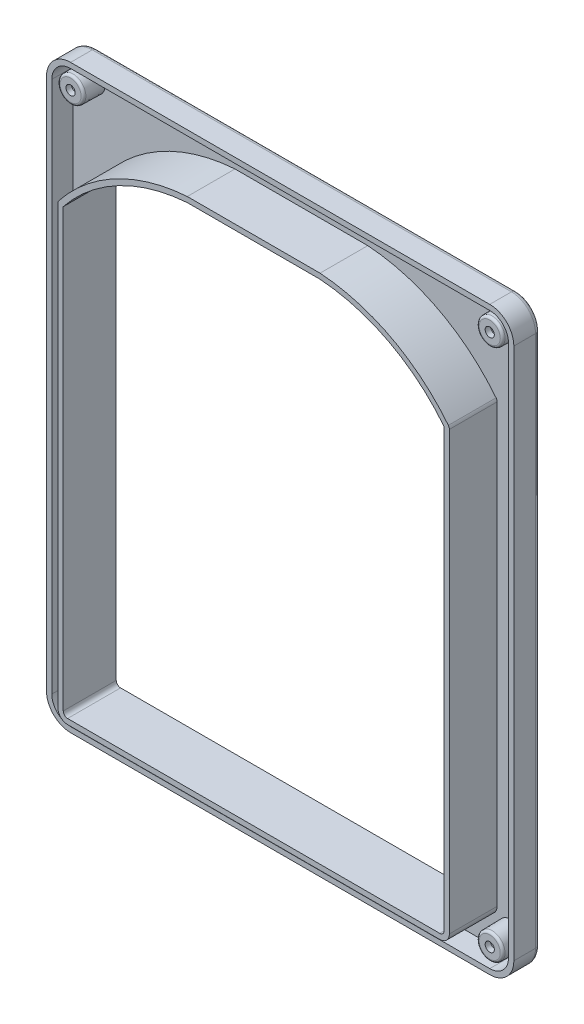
from build123d import *

# Parameters (mm, degrees)
EXTRUSION1_DEPTH           = 22
ESQUISSE2_R                = 1.75
EXTRUSION2_DEPTH           = 2.2
EXTRU_MINCE1_DEPTH         = 8.8
CONG_1_R                   = 2
ESQUISSE4_R                = 5.5
ESQUISSE4_R_2              = 1.75
EXTRUSION3_DEPTH           = 8.8
EXTRUSION3_DRAFT           = 1
EXTRUSION3_PROFILE_2_DEPTH = 8.8
EXTRUSION3_PROFILE_2_DRAFT = 1
EXTRUSION3_PROFILE_3_DEPTH = 8.8
EXTRUSION3_PROFILE_3_DRAFT = 1
EXTRUSION3_PROFILE_4_DEPTH = 8.8
EXTRUSION3_PROFILE_4_DRAFT = 1
CONG_2_R                   = 1
ESQUISSE5_R                = 3.675
ESQUISSE5_R_2              = 1.75
ENL_V_MAT_EXTRU_1_DEPTH    = 8.8
CONG_3_R                   = 0.5


with BuildPart() as part:
    # Esquisse1 → Extrusion1 (new body)
    with BuildSketch(Plane.XY):
        with BuildLine():
            Line((-77.25, -107.35), (77.25, -107.35))
            ThreePointArc((77.25, -107.35), (80.078427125, -106.178427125), (81.25, -103.35))
            Line((81.25, -103.35), (81.25, 78.029814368))
            ThreePointArc((81.25, 78.029814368), (81.138764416, 78.687514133), (80.817431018, 79.272054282))
            ThreePointArc((80.817431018, 79.272054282), (57.148237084, 98.923080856), (27.561405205, 107.35))
            Line((27.561405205, 107.35), (-27.561405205, 107.35))
            ThreePointArc((-27.561405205, 107.35), (-57.148237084, 98.923080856), (-80.817431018, 79.272054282))
            ThreePointArc((-80.817431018, 79.272054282), (-81.138764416, 78.687514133), (-81.25, 78.029814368))
            Line((-81.25, 78.029814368), (-81.25, -103.35))
            ThreePointArc((-81.25, -103.35), (-80.078427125, -106.178427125), (-77.25, -107.35))
        make_face()
        with BuildLine():
            Line((-77.25, -105.15), (77.25, -105.15))
            ThreePointArc((77.25, -105.15), (78.522792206, -104.622792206), (79.05, -103.35))
            Line((79.05, -103.35), (79.05, 77.960117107))
            ThreePointArc((79.05, 77.960117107), (56.125121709, 96.975455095), (27.484068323, 105.15))
            Line((27.484068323, 105.15), (-27.484068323, 105.15))
            ThreePointArc((-27.484068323, 105.15), (-56.125121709, 96.975455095), (-79.05, 77.960117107))
            Line((-79.05, 77.960117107), (-79.05, -103.35))
            ThreePointArc((-79.05, -103.35), (-78.522792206, -104.622792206), (-77.25, -105.15))
        make_face(mode=Mode.SUBTRACT)
    extrude(amount=EXTRUSION1_DEPTH)

    # Esquisse2 → Extrusion2 (add)
    with BuildSketch(Plane.XY):
        with BuildLine():
            Line((-87, 120.35), (87, 120.35))
            ThreePointArc((87, 120.35), (94.071067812, 117.421067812), (97, 110.35))
            Line((97, 110.35), (97, -110.65))
            ThreePointArc((97, -110.65), (94.071067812, -117.721067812), (87, -120.65))
            Line((87, -120.65), (-87, -120.65))
            ThreePointArc((-87, -120.65), (-94.071067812, -117.721067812), (-97, -110.65))
            Line((-97, -110.65), (-97, 110.35))
            ThreePointArc((-97, 110.35), (-94.071067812, 117.421067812), (-87, 120.35))
        make_face()
        with Locations((87, 110.35)):
            Circle(ESQUISSE2_R, mode=Mode.SUBTRACT)
        with Locations((87, -110.65)):
            Circle(ESQUISSE2_R, mode=Mode.SUBTRACT)
        with Locations(Location((-87, 110.35, 0), (0, 0, 180))):
            Circle(ESQUISSE2_R, mode=Mode.SUBTRACT)
        with Locations((-87, -110.65)):
            Circle(ESQUISSE2_R, mode=Mode.SUBTRACT)
        with BuildLine():
            Line((-77.25, -105.15), (77.25, -105.15))
            ThreePointArc((77.25, -105.15), (78.522792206, -104.622792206), (79.05, -103.35))
            Line((79.05, -103.35), (79.05, 77.960117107))
            ThreePointArc((79.05, 77.960117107), (56.125121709, 96.975455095), (27.484068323, 105.15))
            Line((27.484068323, 105.15), (-27.484068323, 105.15))
            ThreePointArc((-27.484068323, 105.15), (-56.125121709, 96.975455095), (-79.05, 77.960117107))
            Line((-79.05, 77.960117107), (-79.05, -103.35))
            ThreePointArc((-79.05, -103.35), (-78.522792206, -104.622792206), (-77.25, -105.15))
        make_face(mode=Mode.SUBTRACT)
    extrude(amount=EXTRUSION2_DEPTH)

    # Esquisse3 → Extru.-Mince1 (add)
    with BuildSketch(Plane.XY.offset(2.2)):
        with BuildLine():
            Line((-87, -120.65), (87, -120.65))
            ThreePointArc((87, -120.65), (94.071067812, -117.721067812), (97, -110.65))
            Line((97, -110.65), (97, 110.35))
            ThreePointArc((97, 110.35), (94.071067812, 117.421067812), (87, 120.35))
            Line((87, 120.35), (-87, 120.35))
            ThreePointArc((-87, 120.35), (-94.071067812, 117.421067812), (-97, 110.35))
            Line((-97, 110.35), (-97, -110.65))
            ThreePointArc((-97, -110.65), (-94.071067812, -117.721067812), (-87, -120.65))
        make_face()
        with BuildLine():
            Line((-87, -118.45), (87, -118.45))
            ThreePointArc((87, -118.45), (92.515432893, -116.165432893), (94.8, -110.65))
            Line((94.8, -110.65), (94.8, 110.35))
            ThreePointArc((94.8, 110.35), (92.515432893, 115.865432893), (87, 118.15))
            Line((87, 118.15), (-87, 118.15))
            ThreePointArc((-87, 118.15), (-92.515432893, 115.865432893), (-94.8, 110.35))
            Line((-94.8, 110.35), (-94.8, -110.65))
            ThreePointArc((-94.8, -110.65), (-92.515432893, -116.165432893), (-87, -118.45))
        make_face(mode=Mode.SUBTRACT)
    extrude(amount=EXTRU_MINCE1_DEPTH)

    # Cong_1
    cong_1_edges = [part.edges().sort_by_distance(p)[0] for p in [
        (94.071067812, -117.721067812, 0),
        (97, -0.15, 0),
        (94.071067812, 117.421067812, 0),
        (0, 120.35, 0),
        (-94.071067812, 117.421067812, 0),
        (-97, -0.15, 0),
        (-94.071067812, -117.721067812, 0),
        (0, -120.65, 0),
    ]]
    fillet(cong_1_edges, radius=CONG_1_R)


with BuildPart() as extrusion3_tool:
    # Esquisse4 → Extrusion3 (with draft: the straight prism first)
    with BuildSketch(Plane.XY.offset(2.2)):
        with Locations((87, 110.35)):
            Circle(ESQUISSE4_R)
        with Locations((87, 110.35)):
            Circle(ESQUISSE4_R_2, mode=Mode.SUBTRACT)
    extrude(amount=EXTRUSION3_DEPTH)
    # Extrusion3: the draft: its side faces are tilted about the plane it starts from
    extrusion3_sides = [extrusion3_tool.faces().sort_by_distance(p)[0] for p in [
        (81.5, 110.35, 6.6),
        (85.25, 110.35, 6.6),
    ]]
    draft(extrusion3_sides, Plane.XY.offset(2.2), EXTRUSION3_DRAFT)


with BuildPart() as part_1:
    add(part.part)

    # Extrusion3: add extrusion3_tool
    add(extrusion3_tool.part)


with BuildPart() as extrusion3_profile_2_tool:
    # Esquisse4 → Extrusion3 profile 2 (with draft: the straight prism first)
    with BuildSketch(Plane.XY.offset(2.2)):
        with Locations((-87, 110.35)):
            Circle(ESQUISSE4_R)
        with Locations(Location((-87, 110.35, 0), (0, 0, 180))):
            Circle(ESQUISSE4_R_2, mode=Mode.SUBTRACT)
    extrude(amount=EXTRUSION3_PROFILE_2_DEPTH)
    # Extrusion3 profile 2: the draft: its side faces are tilted about the plane it starts from
    extrusion3_profile_2_sides = [extrusion3_profile_2_tool.faces().sort_by_distance(p)[0] for p in [
        (-92.5, 110.35, 6.6),
        (-85.25, 110.35, 6.6),
    ]]
    draft(extrusion3_profile_2_sides, Plane.XY.offset(2.2), EXTRUSION3_PROFILE_2_DRAFT)


with BuildPart() as part_2:
    add(part_1.part)

    # Extrusion3 profile 2: add extrusion3_profile_2_tool
    add(extrusion3_profile_2_tool.part)


with BuildPart() as extrusion3_profile_3_tool:
    # Esquisse4 → Extrusion3 profile 3 (with draft: the straight prism first)
    with BuildSketch(Plane.XY.offset(2.2)):
        with Locations((-87, -110.65)):
            Circle(ESQUISSE4_R)
        with Locations((-87, -110.65)):
            Circle(ESQUISSE4_R_2, mode=Mode.SUBTRACT)
    extrude(amount=EXTRUSION3_PROFILE_3_DEPTH)
    # Extrusion3 profile 3: the draft: its side faces are tilted about the plane it starts from
    extrusion3_profile_3_sides = [extrusion3_profile_3_tool.faces().sort_by_distance(p)[0] for p in [
        (-92.5, -110.65, 6.6),
        (-88.75, -110.65, 6.6),
    ]]
    draft(extrusion3_profile_3_sides, Plane.XY.offset(2.2), EXTRUSION3_PROFILE_3_DRAFT)


with BuildPart() as part_3:
    add(part_2.part)

    # Extrusion3 profile 3: add extrusion3_profile_3_tool
    add(extrusion3_profile_3_tool.part)


with BuildPart() as extrusion3_profile_4_tool:
    # Esquisse4 → Extrusion3 profile 4 (with draft: the straight prism first)
    with BuildSketch(Plane.XY.offset(2.2)):
        with Locations((87, -110.65)):
            Circle(ESQUISSE4_R)
        with Locations((87, -110.65)):
            Circle(ESQUISSE4_R_2, mode=Mode.SUBTRACT)
    extrude(amount=EXTRUSION3_PROFILE_4_DEPTH)
    # Extrusion3 profile 4: the draft: its side faces are tilted about the plane it starts from
    extrusion3_profile_4_sides = [extrusion3_profile_4_tool.faces().sort_by_distance(p)[0] for p in [
        (81.5, -110.65, 6.6),
        (85.25, -110.65, 6.6),
    ]]
    draft(extrusion3_profile_4_sides, Plane.XY.offset(2.2), EXTRUSION3_PROFILE_4_DRAFT)


with BuildPart() as part_4:
    add(part_3.part)

    # Extrusion3 profile 4: add extrusion3_profile_4_tool
    add(extrusion3_profile_4_tool.part)

    # Cong_2
    cong_2_edges = [part_4.edges().sort_by_distance(p)[0] for p in [
        (81.653604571, 110.35, 11),
        (-92.346395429, 110.35, 11),
        (-92.346395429, -110.65, 11),
        (81.653604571, -110.65, 11),
    ]]
    fillet(cong_2_edges, radius=CONG_2_R)

    # Esquisse5 → Enl_v. mat.-Extru.1 (cut)
    # profile 1 of 4: a face of its own
    with BuildSketch(Plane(origin=(0, 0, 0), x_dir=(-1, 0, 0), z_dir=(0, 0, -1))):
        with Locations((87, 110.35)):
            Circle(ESQUISSE5_R)
        with Locations((87, 110.35)):
            Circle(ESQUISSE5_R_2, mode=Mode.SUBTRACT)
    # profile 2 of 4: a face of its own
    with BuildSketch(Plane(origin=(0, 0, 0), x_dir=(-1, 0, 0), z_dir=(0, 0, -1))):
        with Locations((-87, 110.35)):
            Circle(ESQUISSE5_R)
        with Locations((-87, 110.35)):
            Circle(ESQUISSE5_R_2, mode=Mode.SUBTRACT)
    # profile 3 of 4: a face of its own
    with BuildSketch(Plane(origin=(0, 0, 0), x_dir=(-1, 0, 0), z_dir=(0, 0, -1))):
        with Locations((-87, -110.65)):
            Circle(ESQUISSE5_R)
        with Locations((-87, -110.65)):
            Circle(ESQUISSE5_R_2, mode=Mode.SUBTRACT)
    # profile 4 of 4: a face of its own
    with BuildSketch(Plane(origin=(0, 0, 0), x_dir=(-1, 0, 0), z_dir=(0, 0, -1))):
        with Locations((87, -110.65)):
            Circle(ESQUISSE5_R)
        with Locations((87, -110.65)):
            Circle(ESQUISSE5_R_2, mode=Mode.SUBTRACT)
    extrude(amount=-ENL_V_MAT_EXTRU_1_DEPTH, mode=Mode.SUBTRACT)

    # Cong_3
    cong_3_edges = [part_4.edges().sort_by_distance(p)[0] for p in [
        (-83.325, 110.35, 0),
        (90.675, 110.35, 0),
        (90.675, -110.65, 0),
        (-83.325, -110.65, 0),
    ]]
    fillet(cong_3_edges, radius=CONG_3_R)


solid = part_4.part
